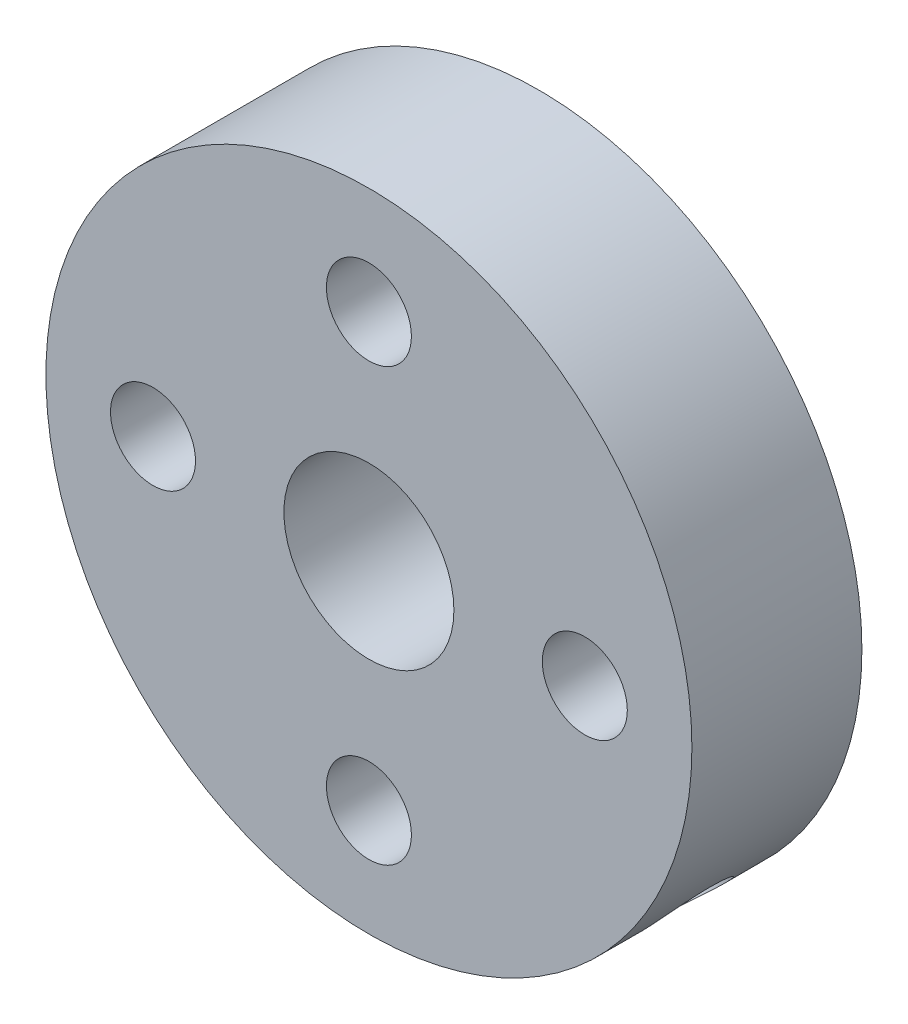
from build123d import *

# Parameters (mm, degrees)
SKETCH1_R                  = 9.5
BOSS_EXTRUDE1_DEPTH        = 5
F_5_0_5_DIAMETER_HOLE1_D   = 5
M3X0_5_TAPPED_HOLE1_D      = 2.5
M3X0_5_TAPPED_HOLE4_REACH  = 25.474
M3X0_5_TAPPED_HOLE4_BORE_R = 1.25


with BuildPart() as part:
    # Sketch1 → Boss-Extrude1 (new body)
    with BuildSketch(Plane.XY):
        Circle(SKETCH1_R)
    extrude(amount=BOSS_EXTRUDE1_DEPTH)

    # 5.0 _5_ Diameter Hole1 (through all)
    with Locations(Plane.XY.offset(5)):
        with Locations((0, 0)):
            Hole(F_5_0_5_DIAMETER_HOLE1_D / 2)

    # M3x0.5 Tapped Hole1 (through all)
    with Locations(Plane.XY.offset(5)):
        with Locations((6.35, 0), (0, -6.35), (-6.35, 0), (0, 6.35), (0, 0)):
            Hole(M3X0_5_TAPPED_HOLE1_D / 2)

    # M3x0.5 Tapped Hole4 bore → M3x0.5 Tapped Hole4 (cut, up to next)
    with BuildSketch(Plane(origin=(6.717514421, -6.717514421, 0), x_dir=(-0.7071067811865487, -0.7071067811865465, 0), z_dir=(0.7071067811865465, -0.7071067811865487, 0)), mode=Mode.PRIVATE) as m3x0_5_tapped_hole4_sk1:
        with Locations((0, -2.5)):
            Circle(M3X0_5_TAPPED_HOLE4_BORE_R)
    m3x0_5_tapped_hole4_tool1 = extrude(m3x0_5_tapped_hole4_sk1.sketch, amount=-M3X0_5_TAPPED_HOLE4_REACH, mode=Mode.PRIVATE) & part.part
    add(m3x0_5_tapped_hole4_tool1.solids().sort_by_distance((6.717514, -6.717514, 2.5))[0], mode=Mode.SUBTRACT)


solid = part.part
